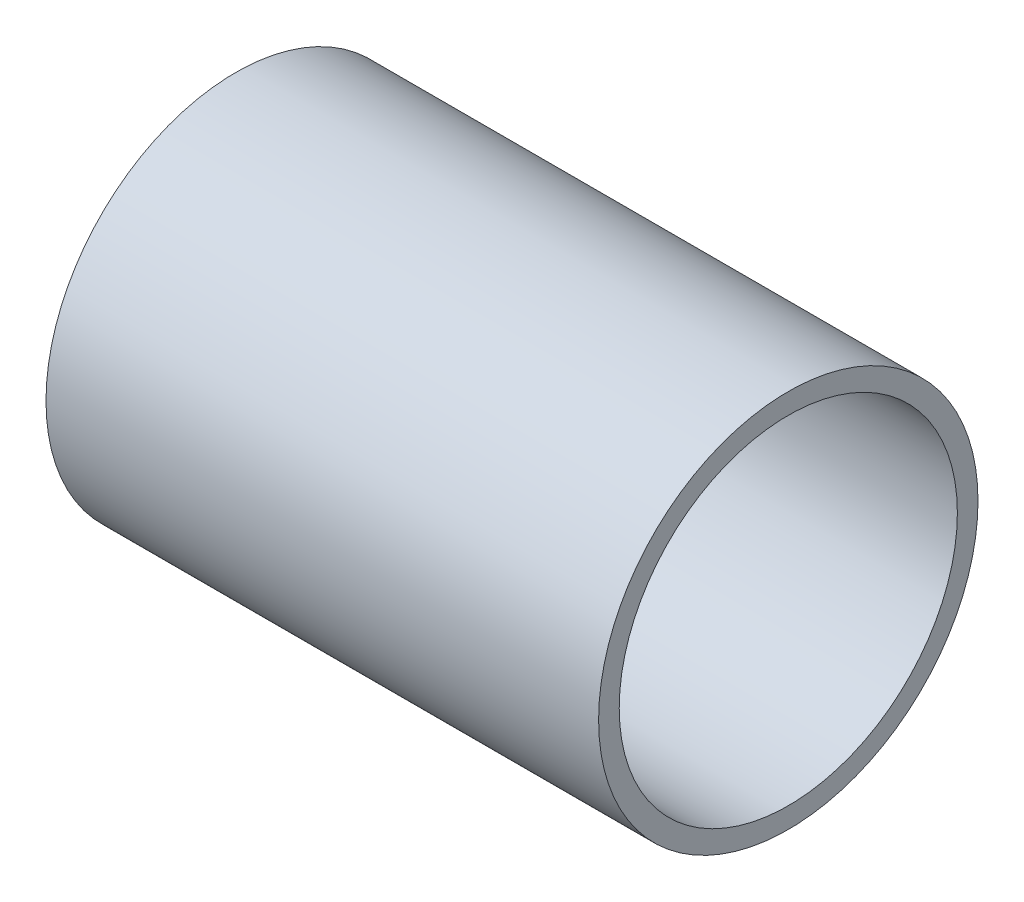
from build123d import *

# Parameters (mm, degrees)
ESQUISSE1_R          = 23
ESQUISSE1_R_2        = 20.5
BASE_EXTRUSION_DEPTH = 67


with BuildPart() as part:
    # Esquisse1 → Base-Extrusion (new body)
    with BuildSketch(Plane(origin=(0, 0, 0), x_dir=(0, 0, -1), z_dir=(1, 0, 0))):
        Circle(ESQUISSE1_R)
        Circle(ESQUISSE1_R_2, mode=Mode.SUBTRACT)
    extrude(amount=BASE_EXTRUSION_DEPTH)


solid = part.part
